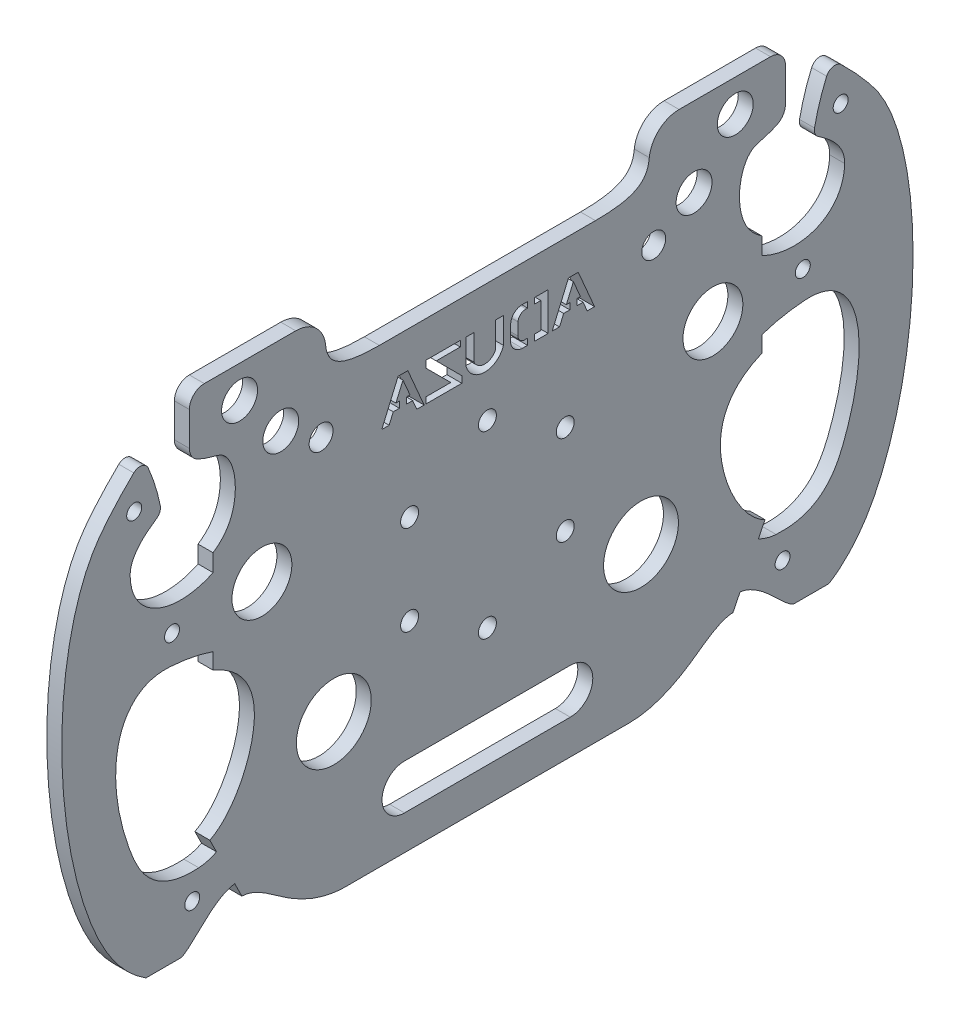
from build123d import *

# Parameters (mm, degrees)
BOSS_EXTRUDE1_DEPTH = 5
CUT_EXTRUDE1_DEPTH  = 10
SKETCH5_R           = 12.5
SKETCH5_R_2         = 6
SKETCH5_R_3         = 10
SKETCH5_R_4         = 4
CUT_EXTRUDE2_DEPTH  = 10
SKETCH6_R           = 3
CUT_EXTRUDE3_DEPTH  = 10
SKETCH8_R           = 2.5
CUT_EXTRUDE5_DEPTH  = 5
FILLET1_R           = 3
CUT_EXTRUDE6_DEPTH  = 172.282279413
BOSS_EXTRUDE2_DEPTH = 5


with BuildPart() as part:
    # Sketch2 → Boss-Extrude1 (new body)
    with BuildSketch(Plane(origin=(0, 0, 0), x_dir=(0, 0, -1), z_dir=(1, 0, 0))):
        with BuildLine():
            Line((36.077617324, 77.286242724), (-36.077617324, 77.286242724))
            add(Edge.make_bspline(
                [(-54.043629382, 86.506435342), (-53.745465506, 83.643077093), (-51.865151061, 79.032980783), (-43.180308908, 77.286242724), (-36.077617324, 77.286242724)],
                knots=[0.310161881, 0.310161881, 0.310161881, 0.310161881, 0.65508094, 1, 1, 1, 1], degree=3))
            ThreePointArc((-54.043629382, 86.506435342), (-57.294967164, 92.898953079), (-63.989850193, 95.470727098))
            Line((-63.989850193, 95.470727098), (-94.519238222, 95.470727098))
            ThreePointArc((-94.519238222, 95.470727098), (-98.054772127, 94.006261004), (-99.519238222, 90.470727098))
            Line((-99.519238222, 90.470727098), (-99.519238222, 79.229702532))
            ThreePointArc((-99.519238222, 79.229702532), (-98.751989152, 76.56815795), (-96.685710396, 74.72344041))
            add(Edge.make_bspline(
                [(-96.685710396, 74.72344041), (-92.684636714, 72.799847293), (-84.671764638, 73.401757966), (-79.982622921, 39.762660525), (-113.970185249, 38.18978645), (-114.285072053, 52.322804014)],
                knots=[0, 0, 0, 0, 0.144743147, 0.476306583, 1, 1, 1, 1], degree=3))
            add(Edge.make_bspline(
                [(-114.285072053, 52.322804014), (-114.313926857, 53.617889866), (-112.999367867, 56.391059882), (-108.940271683, 59.530226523), (-106.224589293, 61.191309)],
                knots=[0, 0, 0, 0, 0.431173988, 0.862347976, 0.862347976, 0.862347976, 0.862347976], degree=3))
            ThreePointArc((-106.224589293, 61.191309), (-104.285401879, 63.379576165), (-103.901493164, 66.278123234))
            add(Edge.make_bspline(
                [(-110.566859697, 86.44849533), (-109.377202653, 84.100598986), (-106.544579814, 77.706903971), (-104.641441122, 70.720822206), (-103.901493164, 66.278123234)],
                knots=[0.195647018, 0.195647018, 0.195647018, 0.195647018, 0.445835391, 0.886101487, 0.886101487, 0.886101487, 0.886101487], degree=3))
            ThreePointArc((-110.566859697, 86.44849533), (-114.075359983, 89.097190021), (-118.319480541, 87.9515031))
            add(Edge.make_bspline(
                [(-118.319480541, 87.9515031), (-122.414715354, 84.368245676), (-127.02589993, 79.58612825), (-150.106183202, 52.628636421), (-151.218071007, -14.612856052), (-130.190062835, -58.843167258), (-122.0723496, -67.524391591), (-116.679942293, -70.892585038)],
                knots=[0.048713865, 0.048713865, 0.048713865, 0.048713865, 0.169988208, 0.253179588, 0.810911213, 0.89178935, 0.992244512, 0.992244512, 0.992244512, 0.992244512], degree=3))
            ThreePointArc((-116.679942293, -70.892585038), (-115.408865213, -71.45829833), (-114.031113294, -71.651865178))
            Line((-114.031113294, -71.651865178), (-102.202736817, -71.651865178))
            add(Edge.make_bspline(
                [(-102.202736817, -71.651865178), (-96.90658073, -71.651865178), (-84.959519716, -51.862837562), (-66.836424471, -68.79790017), (-54.128521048, -73.600752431), (-47.410465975, -73.600752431)],
                knots=[0, 0, 0, 0, 0.325495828, 0.64329716, 1, 1, 1, 1], degree=3))
            Line((-47.410465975, -73.600752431), (47.410465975, -73.600752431))
            add(Edge.make_bspline(
                [(102.202736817, -71.651865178), (96.90658073, -71.651865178), (84.959519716, -51.862837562), (66.836424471, -68.79790017), (54.128521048, -73.600752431), (47.410465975, -73.600752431)],
                knots=[0, 0, 0, 0, 0.325495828, 0.64329716, 1, 1, 1, 1], degree=3))
            Line((102.202736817, -71.651865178), (114.031113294, -71.651865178))
            ThreePointArc((114.031113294, -71.651865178), (115.408865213, -71.45829833), (116.679942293, -70.892585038))
            add(Edge.make_bspline(
                [(118.319480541, 87.9515031), (122.414715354, 84.368245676), (127.02589993, 79.58612825), (150.106183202, 52.628636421), (151.218071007, -14.612856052), (130.190062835, -58.843167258), (122.0723496, -67.524391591), (116.679942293, -70.892585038)],
                knots=[0.048713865, 0.048713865, 0.048713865, 0.048713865, 0.169988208, 0.253179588, 0.810911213, 0.89178935, 0.992244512, 0.992244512, 0.992244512, 0.992244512], degree=3))
            ThreePointArc((118.319480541, 87.9515031), (114.075359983, 89.097190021), (110.566859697, 86.44849533))
            add(Edge.make_bspline(
                [(110.566859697, 86.44849533), (109.377202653, 84.100598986), (106.544579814, 77.706903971), (104.641441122, 70.720822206), (103.901493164, 66.278123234)],
                knots=[0.195647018, 0.195647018, 0.195647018, 0.195647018, 0.445835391, 0.886101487, 0.886101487, 0.886101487, 0.886101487], degree=3))
            ThreePointArc((103.901493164, 66.278123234), (104.285401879, 63.379576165), (106.224589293, 61.191309))
            add(Edge.make_bspline(
                [(114.285072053, 52.322804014), (114.313926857, 53.617889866), (112.999367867, 56.391059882), (108.940271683, 59.530226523), (106.224589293, 61.191309)],
                knots=[0, 0, 0, 0, 0.431173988, 0.862347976, 0.862347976, 0.862347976, 0.862347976], degree=3))
            add(Edge.make_bspline(
                [(96.685710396, 74.72344041), (92.684636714, 72.799847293), (84.671764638, 73.401757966), (79.982622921, 39.762660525), (113.970185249, 38.18978645), (114.285072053, 52.322804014)],
                knots=[0, 0, 0, 0, 0.144743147, 0.476306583, 1, 1, 1, 1], degree=3))
            ThreePointArc((96.685710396, 74.72344041), (98.751989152, 76.56815795), (99.519238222, 79.229702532))
            Line((99.519238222, 79.229702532), (99.519238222, 90.470727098))
            ThreePointArc((99.519238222, 90.470727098), (98.054772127, 94.006261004), (94.519238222, 95.470727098))
            Line((94.519238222, 95.470727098), (63.989850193, 95.470727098))
            ThreePointArc((63.989850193, 95.470727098), (57.294967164, 92.898953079), (54.043629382, 86.506435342))
            add(Edge.make_bspline(
                [(54.043629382, 86.506435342), (53.745465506, 83.643077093), (51.865151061, 79.032980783), (43.180308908, 77.286242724), (36.077617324, 77.286242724)],
                knots=[0.310161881, 0.310161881, 0.310161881, 0.310161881, 0.65508094, 1, 1, 1, 1], degree=3))
        make_face()
        with BuildLine():
            add(Edge.make_bspline(
                [(-106.271181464, 14.313434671), (-87.884642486, 13.000110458), (-68.290088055, -3.350390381), (-86.730031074, -37.998964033), (-96.685710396, -38.614141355)],
                knots=[0, 0, 0, 0, 0.501338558, 1, 1, 1, 1], degree=3))
            add(Edge.make_bspline(
                [(-106.271181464, 14.313434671), (-111.380386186, 14.678377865), (-115.531616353, 11.405445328), (-121.180932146, -0.28797383), (-118.064304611, -17.50330702), (-110.88307914, -34.67215465), (-105.113221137, -39.134890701), (-96.685710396, -38.614141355)],
                knots=[0, 0, 0, 0, 0.114693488, 0.187207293, 0.665367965, 0.752624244, 1, 1, 1, 1], degree=3))
        make_face(mode=Mode.SUBTRACT)
        with BuildLine():
            add(Edge.make_bspline(
                [(106.271181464, 14.313434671), (111.380386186, 14.678377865), (115.531616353, 11.405445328), (121.180932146, -0.28797383), (118.064304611, -17.50330702), (110.88307914, -34.67215465), (105.113221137, -39.134890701), (96.685710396, -38.614141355)],
                knots=[0, 0, 0, 0, 0.114693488, 0.187207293, 0.665367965, 0.752624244, 1, 1, 1, 1], degree=3))
            add(Edge.make_bspline(
                [(106.271181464, 14.313434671), (87.884642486, 13.000110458), (68.290088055, -3.350390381), (86.730031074, -37.998964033), (96.685710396, -38.614141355)],
                knots=[0, 0, 0, 0, 0.501338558, 1, 1, 1, 1], degree=3))
        make_face(mode=Mode.SUBTRACT)
    extrude(amount=BOSS_EXTRUDE1_DEPTH)

    # Sketch3 → Cut-Extrude1 (cut)
    with BuildSketch(Plane(origin=(5, 0, 0), x_dir=(0, 0, -1), z_dir=(1, 0, 0))):
        with BuildLine():
            Line((-91.612255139, 16.506487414), (-91.612255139, -1.654985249))
            Line((-91.612255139, -1.654985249), (-101.27205871, -20.196794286))
            Line((-101.27205871, -20.196794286), (-90.450694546, -41.963556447))
            add(Edge.make_bspline(
                [(-96.37734056, -43.6046231), (-95.385594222, -43.54334151), (-94.420574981, -43.378099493), (-93.007720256, -42.995364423), (-92.542582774, -42.845170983), (-91.623354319, -42.501816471), (-91.167421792, -42.30774545), (-90.630586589, -42.052038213), (-90.540402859, -42.008143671), (-90.450694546, -41.963556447)],
                knots=[0, 0, 0, 0, 0.03125, 0.03125, 0.046875, 0.046875, 0.0625, 0.0625, 0.065675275, 0.065675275, 0.065675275, 0.065675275], degree=3))
            add(Edge.make_bspline(
                [(-105.914946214, 19.30072817), (-106.8448988, 19.367153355), (-107.77065405, 19.376805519), (-109.611961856, 19.258108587), (-110.527528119, 19.129944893), (-111.891399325, 18.809497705), (-112.340161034, 18.682065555), (-113.217588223, 18.386652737), (-114.077397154, 18.050130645), (-114.900789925, 17.628637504), (-115.705240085, 17.162944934), (-116.099517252, 16.906621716), (-117.228151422, 16.087626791), (-117.915936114, 15.471243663), (-118.862426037, 14.453905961), (-119.164420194, 14.098428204), (-119.740128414, 13.364017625), (-120.011769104, 12.987868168), (-120.777789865, 11.832443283), (-121.222488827, 11.025761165), (-121.8004058, 9.766568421), (-121.978360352, 9.338736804), (-122.309445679, 8.46937948), (-122.462713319, 8.028860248), (-123.168838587, 5.822041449), (-123.547253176, 4.02215885), (-123.908109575, 1.284163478), (-123.993482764, 0.365053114), (-124.102461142, -1.484570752), (-124.125760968, -2.413299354), (-124.114281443, -5.180380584), (-123.999789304, -7.011773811), (-123.606444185, -10.654057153), (-123.327181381, -12.464896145), (-122.63107448, -16.06941162), (-122.213597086, -17.864831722), (-121.25675725, -21.432720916), (-120.720087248, -23.195716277), (-119.833258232, -25.810781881), (-119.523947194, -26.677542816), (-118.877647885, -28.40111076), (-118.540186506, -29.257747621), (-117.811235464, -30.951590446), (-117.418761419, -31.790770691), (-116.55735152, -33.431275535), (-116.091274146, -34.226941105), (-115.070355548, -35.756573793), (-114.515662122, -36.490643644), (-113.603906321, -37.536339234), (-113.285237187, -37.877046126), (-112.627244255, -38.530209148), (-111.610191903, -39.467419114), (-110.13287892, -40.545491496), (-108.932594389, -41.223455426), (-108.111707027, -41.646147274), (-107.689004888, -41.84360726), (-105.550816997, -42.745811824), (-103.766265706, -43.198903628), (-100.082340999, -43.688207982), (-98.230921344, -43.719158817), (-96.37734056, -43.6046231)],
                knots=[0, 0, 0, 0, 0.03125, 0.03125, 0.0625, 0.0625, 0.078125, 0.078125, 0.09375, 0.109375, 0.109375, 0.125, 0.125, 0.15625, 0.15625, 0.171875, 0.171875, 0.1875, 0.1875, 0.21875, 0.21875, 0.234375, 0.234375, 0.25, 0.25, 0.3125, 0.3125, 0.34375, 0.34375, 0.375, 0.375, 0.4375, 0.4375, 0.5, 0.5, 0.5625, 0.5625, 0.625, 0.625, 0.65625, 0.65625, 0.6875, 0.6875, 0.71875, 0.71875, 0.75, 0.75, 0.78125, 0.78125, 0.796875, 0.796875, 0.8125, 0.84375, 0.859375, 0.859375, 0.875, 0.875, 0.9375, 0.9375, 1, 1, 1, 1], degree=3))
            add(Edge.make_bspline(
                [(-91.612255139, 16.506487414), (-92.516137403, 16.827204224), (-93.430163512, 17.115401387), (-96.224578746, 17.902318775), (-98.132632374, 18.312350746), (-102.007792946, 18.943098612), (-103.956995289, 19.160874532), (-105.914946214, 19.30072817)],
                knots=[0.844181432, 0.844181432, 0.844181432, 0.844181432, 0.875, 0.875, 0.9375, 0.9375, 1, 1, 1, 1], degree=3))
        make_face()
        with BuildLine():
            Line((-114.031113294, 101.59311649), (-189.623545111, 64.012275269))
            Line((-189.623545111, 64.012275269), (-156.592956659, -92.021286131))
            Line((-156.592956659, -92.021286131), (-74.232209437, -74.586421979))
            Line((-74.232209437, -74.586421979), (-84.370848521, -54.192935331))
            add(Edge.make_bspline(
                [(-102.259159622, -66.651865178), (-102.177610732, -66.631436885), (-102.101868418, -66.601066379), (-101.952104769, -66.537378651), (-101.732608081, -66.433031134), (-101.522557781, -66.312509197), (-101.109667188, -66.059120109), (-100.844049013, -65.873684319), (-100.062105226, -65.291846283), (-99.566537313, -64.874322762), (-98.110032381, -63.590426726), (-97.179151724, -62.690323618), (-95.306545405, -60.902057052), (-94.366562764, -60.010422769), (-92.425523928, -58.307505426), (-91.425261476, -57.494988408), (-89.828381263, -56.402539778), (-89.279838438, -56.059665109), (-88.138031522, -55.432467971), (-87.550488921, -55.151842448), (-86.350068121, -54.678843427), (-85.73490124, -54.486074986), (-84.861895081, -54.284027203), (-84.617114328, -54.23494298), (-84.370848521, -54.192935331)],
                knots=[0, 0, 0, 0, 0.00390625, 0.00390625, 0.0078125, 0.015625, 0.015625, 0.03125, 0.03125, 0.0625, 0.0625, 0.125, 0.125, 0.1875, 0.1875, 0.25, 0.25, 0.28125, 0.28125, 0.3125, 0.3125, 0.34375, 0.34375, 0.355725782, 0.355725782, 0.355725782, 0.355725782], degree=3))
            Line((-102.259159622, -66.651865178), (-114.031113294, -66.651865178))
            add(Edge.make_bspline(
                [(-115.026995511, 84.188586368), (-116.347183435, 83.03344548), (-117.639836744, 81.853429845), (-120.147310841, 79.423084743), (-121.360995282, 78.171728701), (-123.13727394, 76.254721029), (-123.72246712, 75.609485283), (-124.884342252, 74.311324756), (-125.462162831, 73.659428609), (-127.171161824, 71.681640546), (-128.27578223, 70.331756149), (-129.826058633, 68.210578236), (-130.325236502, 67.487636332), (-131.280703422, 66.003006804), (-131.730665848, 65.248958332), (-133.005984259, 62.960933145), (-133.760805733, 61.399936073), (-135.132000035, 58.226204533), (-135.747777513, 56.613247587), (-136.869261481, 53.346200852), (-137.374734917, 51.692023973), (-138.29358626, 48.34925469), (-138.706856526, 46.660622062), (-139.266678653, 44.105220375), (-139.443132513, 43.249991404), (-139.775638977, 41.540599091), (-139.931924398, 40.68539282), (-140.666934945, 36.406986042), (-141.108043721, 32.976742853), (-141.752659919, 26.104096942), (-141.95554978, 22.661662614), (-142.149549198, 15.765955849), (-142.140437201, 12.312672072), (-141.974916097, 7.124975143), (-141.894319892, 5.394441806), (-141.682225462, 1.93077016), (-141.550515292, 0.195443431), (-141.079381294, -4.997165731), (-140.66505732, -8.43674348), (-139.629304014, -15.270108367), (-139.007972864, -18.663917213), (-137.537999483, -25.401276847), (-136.689643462, -28.744890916), (-134.726497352, -35.373210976), (-133.612960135, -38.658193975), (-131.68724477, -43.529197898), (-131.004668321, -45.133809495), (-129.535569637, -48.284674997), (-128.748610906, -49.832013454), (-127.041789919, -52.855446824), (-126.121767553, -54.33145591), (-124.619705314, -56.480055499), (-124.097556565, -57.1867547), (-123.021141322, -58.560793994), (-122.465802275, -59.229833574), (-120.745168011, -61.179629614), (-119.525666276, -62.403494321), (-116.916277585, -64.672398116), (-115.526660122, -65.717720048), (-114.031113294, -66.651865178)],
                knots=[0, 0, 0, 0, 0.03125, 0.03125, 0.0625, 0.0625, 0.078125, 0.078125, 0.09375, 0.09375, 0.125, 0.125, 0.140625, 0.140625, 0.15625, 0.15625, 0.1875, 0.1875, 0.21875, 0.21875, 0.25, 0.25, 0.28125, 0.28125, 0.296875, 0.296875, 0.3125, 0.3125, 0.375, 0.375, 0.4375, 0.4375, 0.5, 0.5, 0.53125, 0.53125, 0.5625, 0.5625, 0.625, 0.625, 0.6875, 0.6875, 0.75, 0.75, 0.8125, 0.8125, 0.84375, 0.84375, 0.875, 0.875, 0.90625, 0.90625, 0.921875, 0.921875, 0.9375, 0.9375, 0.96875, 0.96875, 1, 1, 1, 1], degree=3))
            add(Edge.make_bspline(
                [(-108.833553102, 65.456670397), (-109.104978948, 67.08633004), (-109.442284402, 68.701819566), (-110.239432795, 71.906441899), (-110.698920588, 73.493468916), (-111.735386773, 76.62779999), (-112.313353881, 78.176723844), (-113.585375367, 81.219419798), (-114.280429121, 82.715169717), (-115.026995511, 84.188586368)],
                knots=[0, 0, 0, 0, 0.25, 0.25, 0.5, 0.5, 0.75, 0.75, 1, 1, 1, 1], degree=3))
            add(Edge.make_bspline(
                [(-119.283831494, 52.211430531), (-119.300436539, 52.956712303), (-119.221360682, 53.686827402), (-118.975464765, 54.761824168), (-118.8717027, 55.11790278), (-118.624450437, 55.818539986), (-118.482635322, 56.158875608), (-118.009316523, 57.153607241), (-117.63014218, 57.781839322), (-116.985892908, 58.682756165), (-116.758028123, 58.976537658), (-116.286896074, 59.543678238), (-116.042856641, 59.818205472), (-114.786984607, 61.152768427), (-113.671564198, 62.102252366), (-111.908449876, 63.430445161), (-111.305801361, 63.855842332), (-110.08308768, 64.676408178), (-109.46209651, 65.072213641), (-108.833553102, 65.456670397)],
                knots=[0, 0, 0, 0, 0.125, 0.125, 0.1875, 0.1875, 0.25, 0.25, 0.375, 0.375, 0.4375, 0.4375, 0.5, 0.5, 0.75, 0.75, 0.875, 0.875, 1, 1, 1, 1], degree=3))
            add(Edge.make_bspline(
                [(-91.612255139, 39.359495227), (-91.700782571, 39.316261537), (-91.789614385, 39.273535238), (-92.301349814, 39.031142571), (-92.731893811, 38.841946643), (-93.601314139, 38.488724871), (-94.039169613, 38.325028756), (-96.243750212, 37.56938387), (-98.05532441, 37.16158724), (-100.383399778, 36.913016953), (-100.853424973, 36.876658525), (-101.78901721, 36.832565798), (-102.25567204, 36.824648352), (-103.652140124, 36.844180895), (-104.578481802, 36.914608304), (-105.960344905, 37.114947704), (-106.419685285, 37.197581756), (-107.335604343, 37.3970392), (-107.793582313, 37.514392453), (-109.141486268, 37.915738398), (-110.011332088, 38.249534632), (-111.268909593, 38.858919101), (-111.680204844, 39.080236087), (-112.485846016, 39.561907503), (-112.881310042, 39.823352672), (-114.015381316, 40.652107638), (-114.710181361, 41.267851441), (-115.658100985, 42.288815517), (-115.958299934, 42.645424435), (-116.525937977, 43.392468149), (-116.793934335, 43.784336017), (-117.529512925, 44.983443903), (-117.93591192, 45.822095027), (-118.427212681, 47.135350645), (-118.571409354, 47.583197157), (-118.819723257, 48.493565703), (-118.922770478, 48.951797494), (-119.173448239, 50.334933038), (-119.26281717, 51.26824776), (-119.283831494, 52.211430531)],
                knots=[0.59045436, 0.59045436, 0.59045436, 0.59045436, 0.59375, 0.59375, 0.609375, 0.609375, 0.625, 0.625, 0.6875, 0.6875, 0.703125, 0.703125, 0.71875, 0.71875, 0.75, 0.75, 0.765625, 0.765625, 0.78125, 0.78125, 0.8125, 0.8125, 0.828125, 0.828125, 0.84375, 0.84375, 0.875, 0.875, 0.890625, 0.890625, 0.90625, 0.90625, 0.9375, 0.9375, 0.953125, 0.953125, 0.96875, 0.96875, 1, 1, 1, 1], degree=3))
            Line((-91.612255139, 39.359495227), (-91.612255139, 52.211430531))
            Line((-91.612255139, 52.211430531), (-114.031113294, 101.59311649))
        make_face()
        with BuildLine():
            Line((91.612255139, 16.506487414), (91.612255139, -1.654985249))
            Line((91.612255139, -1.654985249), (101.27205871, -20.196794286))
            Line((101.27205871, -20.196794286), (90.450694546, -41.963556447))
            add(Edge.make_bspline(
                [(96.37734056, -43.6046231), (95.385594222, -43.54334151), (94.420574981, -43.378099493), (93.007720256, -42.995364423), (92.542582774, -42.845170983), (91.623354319, -42.501816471), (91.167421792, -42.30774545), (90.630586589, -42.052038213), (90.540402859, -42.008143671), (90.450694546, -41.963556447)],
                knots=[0, 0, 0, 0, 0.03125, 0.03125, 0.046875, 0.046875, 0.0625, 0.0625, 0.065675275, 0.065675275, 0.065675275, 0.065675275], degree=3))
            add(Edge.make_bspline(
                [(105.914946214, 19.30072817), (106.8448988, 19.367153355), (107.77065405, 19.376805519), (109.611961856, 19.258108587), (110.527528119, 19.129944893), (111.891399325, 18.809497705), (112.340161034, 18.682065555), (113.217588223, 18.386652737), (114.077397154, 18.050130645), (114.900789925, 17.628637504), (115.705240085, 17.162944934), (116.099517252, 16.906621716), (117.228151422, 16.087626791), (117.915936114, 15.471243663), (118.862426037, 14.453905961), (119.164420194, 14.098428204), (119.740128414, 13.364017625), (120.011769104, 12.987868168), (120.777789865, 11.832443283), (121.222488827, 11.025761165), (121.8004058, 9.766568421), (121.978360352, 9.338736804), (122.309445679, 8.46937948), (122.462713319, 8.028860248), (123.168838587, 5.822041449), (123.547253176, 4.02215885), (123.908109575, 1.284163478), (123.993482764, 0.365053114), (124.102461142, -1.484570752), (124.125760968, -2.413299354), (124.114281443, -5.180380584), (123.999789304, -7.011773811), (123.606444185, -10.654057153), (123.327181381, -12.464896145), (122.63107448, -16.06941162), (122.213597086, -17.864831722), (121.25675725, -21.432720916), (120.720087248, -23.195716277), (119.833258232, -25.810781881), (119.523947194, -26.677542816), (118.877647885, -28.40111076), (118.540186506, -29.257747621), (117.811235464, -30.951590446), (117.418761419, -31.790770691), (116.55735152, -33.431275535), (116.091274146, -34.226941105), (115.070355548, -35.756573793), (114.515662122, -36.490643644), (113.603906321, -37.536339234), (113.285237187, -37.877046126), (112.627244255, -38.530209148), (111.610191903, -39.467419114), (110.13287892, -40.545491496), (108.932594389, -41.223455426), (108.111707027, -41.646147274), (107.689004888, -41.84360726), (105.550816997, -42.745811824), (103.766265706, -43.198903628), (100.082340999, -43.688207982), (98.230921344, -43.719158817), (96.37734056, -43.6046231)],
                knots=[0, 0, 0, 0, 0.03125, 0.03125, 0.0625, 0.0625, 0.078125, 0.078125, 0.09375, 0.109375, 0.109375, 0.125, 0.125, 0.15625, 0.15625, 0.171875, 0.171875, 0.1875, 0.1875, 0.21875, 0.21875, 0.234375, 0.234375, 0.25, 0.25, 0.3125, 0.3125, 0.34375, 0.34375, 0.375, 0.375, 0.4375, 0.4375, 0.5, 0.5, 0.5625, 0.5625, 0.625, 0.625, 0.65625, 0.65625, 0.6875, 0.6875, 0.71875, 0.71875, 0.75, 0.75, 0.78125, 0.78125, 0.796875, 0.796875, 0.8125, 0.84375, 0.859375, 0.859375, 0.875, 0.875, 0.9375, 0.9375, 1, 1, 1, 1], degree=3))
            add(Edge.make_bspline(
                [(91.612255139, 16.506487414), (92.516137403, 16.827204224), (93.430163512, 17.115401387), (96.224578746, 17.902318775), (98.132632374, 18.312350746), (102.007792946, 18.943098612), (103.956995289, 19.160874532), (105.914946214, 19.30072817)],
                knots=[0.844181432, 0.844181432, 0.844181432, 0.844181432, 0.875, 0.875, 0.9375, 0.9375, 1, 1, 1, 1], degree=3))
        make_face()
        with BuildLine():
            Line((114.031113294, -66.651865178), (102.259159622, -66.651865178))
            add(Edge.make_bspline(
                [(102.259159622, -66.651865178), (102.177610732, -66.631436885), (102.101868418, -66.601066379), (101.952104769, -66.537378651), (101.732608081, -66.433031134), (101.522557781, -66.312509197), (101.109667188, -66.059120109), (100.844049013, -65.873684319), (100.062105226, -65.291846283), (99.566537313, -64.874322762), (98.110032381, -63.590426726), (97.179151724, -62.690323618), (95.306545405, -60.902057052), (94.366562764, -60.010422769), (92.425523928, -58.307505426), (91.425261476, -57.494988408), (89.828381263, -56.402539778), (89.279838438, -56.059665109), (88.138031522, -55.432467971), (87.550488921, -55.151842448), (86.350068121, -54.678843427), (85.73490124, -54.486074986), (84.861895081, -54.284027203), (84.617114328, -54.23494298), (84.370848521, -54.192935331)],
                knots=[0, 0, 0, 0, 0.00390625, 0.00390625, 0.0078125, 0.015625, 0.015625, 0.03125, 0.03125, 0.0625, 0.0625, 0.125, 0.125, 0.1875, 0.1875, 0.25, 0.25, 0.28125, 0.28125, 0.3125, 0.3125, 0.34375, 0.34375, 0.355725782, 0.355725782, 0.355725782, 0.355725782], degree=3))
            Line((84.370848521, -54.192935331), (74.232209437, -74.586421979))
            Line((74.232209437, -74.586421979), (156.592956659, -92.021286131))
            Line((156.592956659, -92.021286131), (189.623545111, 64.012275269))
            Line((189.623545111, 64.012275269), (114.031113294, 101.59311649))
            Line((114.031113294, 101.59311649), (91.612255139, 52.211430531))
            Line((91.612255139, 52.211430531), (91.612255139, 39.359495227))
            add(Edge.make_bspline(
                [(91.612255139, 39.359495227), (91.700782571, 39.316261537), (91.789614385, 39.273535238), (92.301349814, 39.031142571), (92.731893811, 38.841946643), (93.601314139, 38.488724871), (94.039169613, 38.325028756), (96.243750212, 37.56938387), (98.05532441, 37.16158724), (100.383399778, 36.913016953), (100.853424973, 36.876658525), (101.78901721, 36.832565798), (102.25567204, 36.824648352), (103.652140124, 36.844180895), (104.578481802, 36.914608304), (105.960344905, 37.114947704), (106.419685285, 37.197581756), (107.335604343, 37.3970392), (107.793582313, 37.514392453), (109.141486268, 37.915738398), (110.011332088, 38.249534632), (111.268909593, 38.858919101), (111.680204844, 39.080236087), (112.485846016, 39.561907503), (112.881310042, 39.823352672), (114.015381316, 40.652107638), (114.710181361, 41.267851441), (115.658100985, 42.288815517), (115.958299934, 42.645424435), (116.525937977, 43.392468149), (116.793934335, 43.784336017), (117.529512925, 44.983443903), (117.93591192, 45.822095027), (118.427212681, 47.135350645), (118.571409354, 47.583197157), (118.819723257, 48.493565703), (118.922770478, 48.951797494), (119.173448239, 50.334933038), (119.26281717, 51.26824776), (119.283831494, 52.211430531)],
                knots=[0.59045436, 0.59045436, 0.59045436, 0.59045436, 0.59375, 0.59375, 0.609375, 0.609375, 0.625, 0.625, 0.6875, 0.6875, 0.703125, 0.703125, 0.71875, 0.71875, 0.75, 0.75, 0.765625, 0.765625, 0.78125, 0.78125, 0.8125, 0.8125, 0.828125, 0.828125, 0.84375, 0.84375, 0.875, 0.875, 0.890625, 0.890625, 0.90625, 0.90625, 0.9375, 0.9375, 0.953125, 0.953125, 0.96875, 0.96875, 1, 1, 1, 1], degree=3))
            add(Edge.make_bspline(
                [(119.283831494, 52.211430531), (119.300436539, 52.956712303), (119.221360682, 53.686827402), (118.975464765, 54.761824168), (118.8717027, 55.11790278), (118.624450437, 55.818539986), (118.482635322, 56.158875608), (118.009316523, 57.153607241), (117.63014218, 57.781839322), (116.985892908, 58.682756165), (116.758028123, 58.976537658), (116.286896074, 59.543678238), (116.042856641, 59.818205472), (114.786984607, 61.152768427), (113.671564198, 62.102252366), (111.908449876, 63.430445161), (111.305801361, 63.855842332), (110.08308768, 64.676408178), (109.46209651, 65.072213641), (108.833553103, 65.456670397)],
                knots=[0, 0, 0, 0, 0.125, 0.125, 0.1875, 0.1875, 0.25, 0.25, 0.375, 0.375, 0.4375, 0.4375, 0.5, 0.5, 0.75, 0.75, 0.875, 0.875, 1, 1, 1, 1], degree=3))
            add(Edge.make_bspline(
                [(108.833553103, 65.456670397), (109.104978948, 67.08633004), (109.442284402, 68.701819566), (110.239432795, 71.906441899), (110.698920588, 73.493468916), (111.735386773, 76.62779999), (112.313353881, 78.176723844), (113.585375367, 81.219419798), (114.280429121, 82.715169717), (115.026995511, 84.188586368)],
                knots=[0, 0, 0, 0, 0.25, 0.25, 0.5, 0.5, 0.75, 0.75, 1, 1, 1, 1], degree=3))
            add(Edge.make_bspline(
                [(115.026995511, 84.188586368), (116.347183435, 83.03344548), (117.639836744, 81.853429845), (120.147310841, 79.423084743), (121.360995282, 78.171728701), (123.13727394, 76.254721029), (123.72246712, 75.609485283), (124.884342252, 74.311324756), (125.462162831, 73.659428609), (127.171161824, 71.681640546), (128.27578223, 70.331756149), (129.826058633, 68.210578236), (130.325236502, 67.487636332), (131.280703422, 66.003006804), (131.730665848, 65.248958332), (133.005984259, 62.960933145), (133.760805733, 61.399936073), (135.132000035, 58.226204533), (135.747777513, 56.613247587), (136.869261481, 53.346200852), (137.374734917, 51.692023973), (138.29358626, 48.34925469), (138.706856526, 46.660622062), (139.266678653, 44.105220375), (139.443132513, 43.249991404), (139.775638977, 41.540599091), (139.931924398, 40.68539282), (140.666934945, 36.406986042), (141.108043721, 32.976742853), (141.752659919, 26.104096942), (141.95554978, 22.661662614), (142.149549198, 15.765955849), (142.140437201, 12.312672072), (141.974916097, 7.124975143), (141.894319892, 5.394441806), (141.682225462, 1.93077016), (141.550515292, 0.195443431), (141.079381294, -4.997165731), (140.66505732, -8.43674348), (139.629304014, -15.270108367), (139.007972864, -18.663917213), (137.537999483, -25.401276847), (136.689643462, -28.744890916), (134.726497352, -35.373210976), (133.612960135, -38.658193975), (131.68724477, -43.529197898), (131.004668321, -45.133809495), (129.535569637, -48.284674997), (128.748610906, -49.832013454), (127.041789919, -52.855446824), (126.121767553, -54.33145591), (124.619705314, -56.480055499), (124.097556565, -57.1867547), (123.021141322, -58.560793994), (122.465802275, -59.229833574), (120.745168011, -61.179629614), (119.525666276, -62.403494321), (116.916277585, -64.672398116), (115.526660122, -65.717720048), (114.031113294, -66.651865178)],
                knots=[0, 0, 0, 0, 0.03125, 0.03125, 0.0625, 0.0625, 0.078125, 0.078125, 0.09375, 0.09375, 0.125, 0.125, 0.140625, 0.140625, 0.15625, 0.15625, 0.1875, 0.1875, 0.21875, 0.21875, 0.25, 0.25, 0.28125, 0.28125, 0.296875, 0.296875, 0.3125, 0.3125, 0.375, 0.375, 0.4375, 0.4375, 0.5, 0.5, 0.53125, 0.53125, 0.5625, 0.5625, 0.625, 0.625, 0.6875, 0.6875, 0.75, 0.75, 0.8125, 0.8125, 0.84375, 0.84375, 0.875, 0.875, 0.90625, 0.90625, 0.921875, 0.921875, 0.9375, 0.9375, 0.96875, 0.96875, 1, 1, 1, 1], degree=3))
        make_face()
    extrude(amount=-CUT_EXTRUDE1_DEPTH, mode=Mode.SUBTRACT)

    # Sketch5 → Cut-Extrude2 (cut)
    with BuildSketch(Plane(origin=(5, 0, 0), x_dir=(0, 0, -1), z_dir=(1, 0, 0))):
        with Locations((51.279370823, -23.883455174)):
            Circle(SKETCH5_R)
        with Locations(Location((-51.279370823, -23.883455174, 0), (0, 0, 180))):
            Circle(SKETCH5_R)
        with Locations((69, 69)):
            Circle(SKETCH5_R_2)
        with Locations((75.289853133, 28.563692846)):
            Circle(SKETCH5_R_3)
        with Locations((82.749558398, 84.720593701)):
            Circle(SKETCH5_R_2)
        with Locations((55.524452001, 60.452157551)):
            Circle(SKETCH5_R_4)
        with Locations(Location((-75.289853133, 28.563692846, 0), (0, 0, 180))):
            Circle(SKETCH5_R_3)
        with Locations(Location((-69, 69, 0), (0, 0, 180))):
            Circle(SKETCH5_R_2)
        with Locations(Location((-55.524452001, 60.452157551, 0), (0, 0, 180))):
            Circle(SKETCH5_R_4)
        with Locations(Location((-82.749558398, 84.720593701, 0), (0, 0, 180))):
            Circle(SKETCH5_R_2)
        with BuildLine():
            Line((27.679139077, -62.089185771), (-27.679139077, -62.089185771))
            ThreePointArc((-27.679139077, -62.089185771), (-35.179139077, -54.589185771), (-27.679139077, -47.089185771))
            Line((-27.679139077, -47.089185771), (27.679139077, -47.089185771))
            ThreePointArc((27.679139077, -47.089185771), (35.179139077, -54.589185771), (27.679139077, -62.089185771))
        make_face()
    extrude(amount=-CUT_EXTRUDE2_DEPTH, mode=Mode.SUBTRACT)

    # Sketch6 → Cut-Extrude3 (cut)
    with BuildSketch(Plane(origin=(5, 0, 0), x_dir=(0, 0, -1), z_dir=(1, 0, 0))):
        with Locations((0, 37.598528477)):
            Circle(SKETCH6_R)
        with Locations((25.980762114, 22.598528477)):
            Circle(SKETCH6_R)
        with Locations((25.980762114, -7.401471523)):
            Circle(SKETCH6_R)
        with Locations((0, -22.401471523)):
            Circle(SKETCH6_R)
        with Locations((-25.980762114, -7.401471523)):
            Circle(SKETCH6_R)
        with Locations((-25.980762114, 22.598528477)):
            Circle(SKETCH6_R)
    extrude(amount=-CUT_EXTRUDE3_DEPTH, mode=Mode.SUBTRACT)

    # Sketch8 → Cut-Extrude5 (cut)
    with BuildSketch(Plane.ZY):
        with Locations((105.2978894, 28.674748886)):
            Circle(SKETCH8_R)
        with Locations((98.549018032, -52.180796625)):
            Circle(SKETCH8_R)
        with Locations(Location((-98.549018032, -52.180796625, 0), (0, 0, 180))):
            Circle(SKETCH8_R)
        with Locations(Location((-105.2978894, 28.674748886, 0), (0, 0, 180))):
            Circle(SKETCH8_R)
        with Locations((-117.943006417, 70.167226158)):
            Circle(SKETCH8_R)
        with Locations(Location((117.943006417, 70.167226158, 0), (0, 0, 180))):
            Circle(SKETCH8_R)
    extrude(amount=-CUT_EXTRUDE5_DEPTH, mode=Mode.SUBTRACT)

    # Fillet1
    fillet1_edges = [part.edges().sort_by_distance(p)[0] for p in [
        (2.5, 65.456670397, 108.833553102),
        (2.5, 84.188586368, 115.026995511),
        (2.5, 65.456670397, -108.833553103),
        (2.5, 84.188586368, -115.026995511),
    ]]
    fillet(fillet1_edges, radius=FILLET1_R)

    # Sketch9 → Cut-Extrude6 (cut, through all)
    # profile 1 of 5: a face of its own
    with BuildSketch(Plane.ZY):
        with BuildLine():
            Line((-20.284608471, 52.569859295), (-20.284608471, 65.230704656))
            Line((-20.284608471, 65.230704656), (-11.693729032, 65.230704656))
            ThreePointArc((-11.693729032, 65.230704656), (-8.766953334, 63.991117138), (-7.78262499, 60.968917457))
            Line((-7.78262499, 60.968917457), (-7.78262499, 57.565796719))
            ThreePointArc((-7.78262499, 57.565796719), (-8.577836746, 54.159447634), (-11.693729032, 52.569859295))
            Line((-11.693729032, 52.569859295), (-20.284608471, 52.569859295))
        make_face()
        with BuildLine():
            Line((-17.839541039, 63.32221008), (-12.949319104, 63.32221008))
            ThreePointArc((-12.949319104, 63.32221008), (-11.092809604, 62.712674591), (-10.211065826, 60.968917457))
            Line((-10.211065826, 60.968917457), (-10.211065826, 56.860308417))
            ThreePointArc((-10.211065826, 56.860308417), (-10.861572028, 55.289847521), (-12.432032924, 54.639341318))
            Line((-12.432032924, 54.639341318), (-17.839541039, 54.639341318))
            Line((-17.839541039, 54.639341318), (-17.839541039, 63.32221008))
        make_face(mode=Mode.SUBTRACT)
    # profile 2 of 5: a face of its own
    with BuildSketch(Plane.ZY):
        Polygon((-35.770862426, 52.569859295), (-30.327965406, 65.230704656), (-27.072504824, 65.230704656), (-21.629607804, 52.569859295), (-24.077799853, 52.569859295), (-25.453247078, 55.769318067), (-31.947223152, 55.769318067), (-33.322670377, 52.569859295), align=None)
        Polygon((-31.054609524, 57.845646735), (-26.345860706, 57.845646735), (-28.700235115, 63.32221008), align=None, mode=Mode.SUBTRACT)
    # profile 3 of 5: a face of its own
    with BuildSketch(Plane.ZY):
        Polygon((9.06089477, 65.230704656), (9.06089477, 63.32221008), (17.105503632, 63.32221008), (8.545028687, 54.761735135), (8.545028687, 52.569859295), (20.432056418, 52.569859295), (20.432056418, 54.639341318), (12.230556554, 54.639341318), (20.511297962, 62.920082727), (20.511297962, 65.230704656), align=None)
    # profile 4 of 5: a face of its own
    with BuildSketch(Plane.ZY):
        with BuildLine():
            Line((-5.334901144, 65.230704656), (-5.334901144, 56.60912427))
            ThreePointArc((-5.334901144, 56.60912427), (0.87259546, 51.951830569), (7.080092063, 56.60912427))
            Line((7.080092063, 56.60912427), (7.080092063, 65.230704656))
            Line((7.080092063, 65.230704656), (4.446933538, 65.230704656))
            Line((4.446933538, 65.230704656), (4.446933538, 56.60912427))
            ThreePointArc((4.446933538, 56.60912427), (0.87259546, 54.300997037), (-2.701742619, 56.60912427))
            Line((-2.701742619, 56.60912427), (-2.701742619, 65.230704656))
            Line((-2.701742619, 65.230704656), (-5.334901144, 65.230704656))
        make_face()
    # profile 5 of 5: a face of its own
    with BuildSketch(Plane.ZY):
        Polygon((23.57489452, 52.569859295), (21.126702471, 52.569859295), (26.569599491, 65.230704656), (29.825060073, 65.230704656), (35.267957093, 52.569859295), (32.819765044, 52.569859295), (31.444317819, 55.769318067), (24.950341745, 55.769318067), align=None)
        Polygon((25.842955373, 57.845646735), (28.197329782, 63.32221008), (30.551704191, 57.845646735), align=None, mode=Mode.SUBTRACT)
    extrude(amount=-CUT_EXTRUDE6_DEPTH, mode=Mode.SUBTRACT)


with BuildPart() as cut_extrude6_piece_1:
    # of the separate pieces the step leaves, piece 1, a body of its own (cut_extrude6_pieces)
    add(part.part.solids().sort_by_distance((0, 64.402219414, -110.490508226))[0])



with BuildPart() as cut_extrude6_piece_2:
    # of the separate pieces the step leaves, piece 2, a body of its own (cut_extrude6_pieces)
    add(part.part.solids().sort_by_distance((0, 54.639341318, -12.432032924))[0])


with BuildPart() as cut_extrude6_piece_3:
    # of the separate pieces the step leaves, piece 3, a body of its own (cut_extrude6_pieces)
    add(part.part.solids().sort_by_distance((0, 63.32221008, 28.197329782))[0])


with BuildPart() as cut_extrude6_piece_4:
    # of the separate pieces the step leaves, piece 4, a body of its own (cut_extrude6_pieces)
    add(part.part.solids().sort_by_distance((0, 57.845646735, -31.054609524))[0])


with BuildPart() as cut_extrude6_piece_1_1:
    add(cut_extrude6_piece_1.part)

    add(cut_extrude6_piece_2.part)  # Boss-Extrude2 merges Cut-Extrude6 piece 2

    add(cut_extrude6_piece_3.part)  # Boss-Extrude2 merges Cut-Extrude6 piece 3

    add(cut_extrude6_piece_4.part)  # Boss-Extrude2 merges Cut-Extrude6 piece 4
    # Sketch10 → Boss-Extrude2 (add)
    with BuildSketch(Plane.ZY):
        Polygon((28.197329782, 55.769318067), (29.37595333, 55.769318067), (29.37595333, 57.845646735), (28.197329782, 57.845646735), (27.018706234, 57.845646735), (27.018706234, 55.769318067), align=None)
        Polygon((-28.700235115, 55.769318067), (-27.521611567, 55.769318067), (-27.521611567, 57.845646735), (-28.700235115, 57.845646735), (-29.878858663, 57.845646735), (-29.878858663, 55.769318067), align=None)
        Polygon((-13.404360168, 65.230704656), (-13.404360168, 59.733190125), (-13.404360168, 57.788030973), (-13.404360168, 52.569859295), (-15.663999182, 52.569859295), (-15.663999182, 57.788030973), (-15.663999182, 59.733190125), (-15.663999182, 65.230704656), align=None)
    extrude(amount=-BOSS_EXTRUDE2_DEPTH)


solid = cut_extrude6_piece_1_1.part
